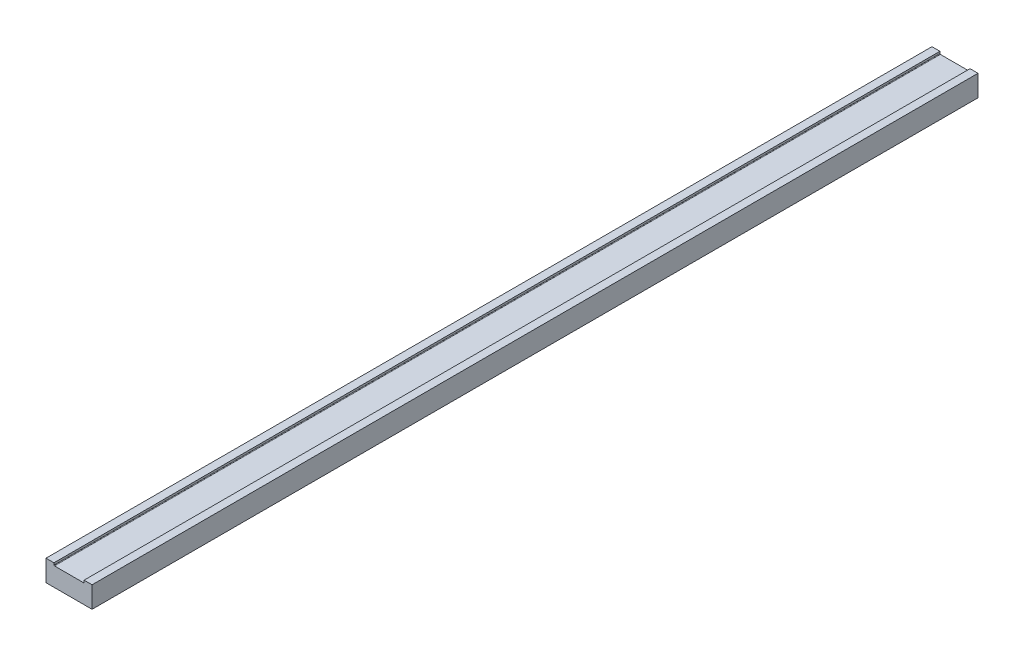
ISO-10303-21;
HEADER;
FILE_DESCRIPTION(('STEP AP214'),'2;1');
FILE_NAME('part.step','',(''),(''),'','','');
FILE_SCHEMA(('AUTOMOTIVE_DESIGN { 1 0 10303 214 1 1 1 1 }'));
ENDSEC;
DATA;
#1=APPLICATION_CONTEXT('core data for automotive mechanical design processes');
#2=APPLICATION_PROTOCOL_DEFINITION('international standard','automotive_design',2000,#1);
#3=PRODUCT_CONTEXT('',#1,'mechanical');
#4=PRODUCT('Part','Part','',(#3));
#5=PRODUCT_RELATED_PRODUCT_CATEGORY('part','',(#4));
#6=PRODUCT_DEFINITION_FORMATION('','',#4);
#7=PRODUCT_DEFINITION_CONTEXT('part definition',#1,'design');
#8=PRODUCT_DEFINITION('design','',#6,#7);
#9=PRODUCT_DEFINITION_SHAPE('','',#8);
#10=(LENGTH_UNIT() NAMED_UNIT(*) SI_UNIT(.MILLI.,.METRE.));
#11=(NAMED_UNIT(*) PLANE_ANGLE_UNIT() SI_UNIT($,.RADIAN.));
#12=(NAMED_UNIT(*) SI_UNIT($,.STERADIAN.) SOLID_ANGLE_UNIT());
#13=UNCERTAINTY_MEASURE_WITH_UNIT(LENGTH_MEASURE(1.E-05),#10,'distance_accuracy_value','');
#14=(GEOMETRIC_REPRESENTATION_CONTEXT(3) GLOBAL_UNCERTAINTY_ASSIGNED_CONTEXT((#13)) GLOBAL_UNIT_ASSIGNED_CONTEXT((#10,
#11,#12)) REPRESENTATION_CONTEXT('',''));
#15=CARTESIAN_POINT('',(0.,0.,0.));
#16=DIRECTION('',(0.,0.,1.));
#17=DIRECTION('',(1.,0.,0.));
#18=AXIS2_PLACEMENT_3D('',#15,#16,#17);
#19=CARTESIAN_POINT('',(-13.,12.,0.));
#20=DIRECTION('',(-1.,0.,0.));
#21=DIRECTION('',(0.,0.,1.));
#22=AXIS2_PLACEMENT_3D('',#19,#20,#21);
#23=PLANE('',#22);
#24=DIRECTION('',(0.,-1.,0.));
#25=VECTOR('',#24,1.);
#26=CARTESIAN_POINT('',(-13.,12.,500.));
#27=LINE('',#26,#25);
#28=CARTESIAN_POINT('',(-13.,12.,500.));
#29=VERTEX_POINT('',#28);
#30=CARTESIAN_POINT('',(-13.,0.,500.));
#31=VERTEX_POINT('',#30);
#32=EDGE_CURVE('E124',#29,#31,#27,.T.);
#33=ORIENTED_EDGE('',*,*,#32,.F.);
#34=DIRECTION('',(0.,0.,1.));
#35=VECTOR('',#34,1.);
#36=CARTESIAN_POINT('',(-13.,12.,0.));
#37=LINE('',#36,#35);
#38=CARTESIAN_POINT('',(-13.,12.,0.));
#39=VERTEX_POINT('',#38);
#40=EDGE_CURVE('E9',#39,#29,#37,.T.);
#41=ORIENTED_EDGE('',*,*,#40,.F.);
#42=DIRECTION('',(0.,-1.,0.));
#43=VECTOR('',#42,1.);
#44=CARTESIAN_POINT('',(-13.,12.,0.));
#45=LINE('',#44,#43);
#46=CARTESIAN_POINT('',(-13.,0.,0.));
#47=VERTEX_POINT('',#46);
#48=EDGE_CURVE('E146',#39,#47,#45,.T.);
#49=ORIENTED_EDGE('',*,*,#48,.T.);
#50=DIRECTION('',(0.,0.,1.));
#51=VECTOR('',#50,1.);
#52=CARTESIAN_POINT('',(-13.,0.,0.));
#53=LINE('',#52,#51);
#54=EDGE_CURVE('E17',#47,#31,#53,.T.);
#55=ORIENTED_EDGE('',*,*,#54,.T.);
#56=EDGE_LOOP('',(#33,#41,#49,#55));
#57=FACE_BOUND('',#56,.T.);
#58=ADVANCED_FACE('F14',(#57),#23,.T.);
#59=CARTESIAN_POINT('',(-13.,12.,0.));
#60=DIRECTION('',(0.,-1.,0.));
#61=DIRECTION('',(1.,0.,0.));
#62=AXIS2_PLACEMENT_3D('',#59,#60,#61);
#63=PLANE('',#62);
#64=DIRECTION('',(1.,0.,0.));
#65=VECTOR('',#64,1.);
#66=CARTESIAN_POINT('',(-13.,12.,500.));
#67=LINE('',#66,#65);
#68=CARTESIAN_POINT('',(-8.5,12.,500.));
#69=VERTEX_POINT('',#68);
#70=EDGE_CURVE('E65',#29,#69,#67,.T.);
#71=ORIENTED_EDGE('',*,*,#70,.T.);
#72=DIRECTION('',(0.,0.,1.));
#73=VECTOR('',#72,1.);
#74=CARTESIAN_POINT('',(-8.5,12.,0.));
#75=LINE('',#74,#73);
#76=CARTESIAN_POINT('',(-8.5,12.,0.));
#77=VERTEX_POINT('',#76);
#78=EDGE_CURVE('E23',#77,#69,#75,.T.);
#79=ORIENTED_EDGE('',*,*,#78,.F.);
#80=DIRECTION('',(1.,0.,0.));
#81=VECTOR('',#80,1.);
#82=CARTESIAN_POINT('',(-13.,12.,0.));
#83=LINE('',#82,#81);
#84=EDGE_CURVE('E102',#39,#77,#83,.T.);
#85=ORIENTED_EDGE('',*,*,#84,.F.);
#86=ORIENTED_EDGE('',*,*,#40,.T.);
#87=EDGE_LOOP('',(#71,#79,#85,#86));
#88=FACE_BOUND('',#87,.T.);
#89=ADVANCED_FACE('F207',(#88),#63,.F.);
#90=CARTESIAN_POINT('',(-8.5,12.,0.));
#91=DIRECTION('',(-1.,-1.57702134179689E-13,0.));
#92=DIRECTION('',(1.57702134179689E-13,-1.,0.));
#93=AXIS2_PLACEMENT_3D('',#90,#91,#92);
#94=PLANE('',#93);
#95=DIRECTION('',(1.57702134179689E-13,-1.,0.));
#96=VECTOR('',#95,1.);
#97=CARTESIAN_POINT('',(-8.5,12.,500.));
#98=LINE('',#97,#96);
#99=CARTESIAN_POINT('',(-8.5,10.8999999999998,500.));
#100=VERTEX_POINT('',#99);
#101=EDGE_CURVE('E109',#69,#100,#98,.T.);
#102=ORIENTED_EDGE('',*,*,#101,.T.);
#103=DIRECTION('',(0.,0.,1.));
#104=VECTOR('',#103,1.);
#105=CARTESIAN_POINT('',(-8.5,10.8999999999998,0.));
#106=LINE('',#105,#104);
#107=CARTESIAN_POINT('',(-8.5,10.8999999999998,0.));
#108=VERTEX_POINT('',#107);
#109=EDGE_CURVE('E106',#108,#100,#106,.T.);
#110=ORIENTED_EDGE('',*,*,#109,.F.);
#111=DIRECTION('',(1.57702134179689E-13,-1.,0.));
#112=VECTOR('',#111,1.);
#113=CARTESIAN_POINT('',(-8.5,12.,0.));
#114=LINE('',#113,#112);
#115=EDGE_CURVE('E95',#77,#108,#114,.T.);
#116=ORIENTED_EDGE('',*,*,#115,.F.);
#117=ORIENTED_EDGE('',*,*,#78,.T.);
#118=EDGE_LOOP('',(#102,#110,#116,#117));
#119=FACE_BOUND('',#118,.T.);
#120=ADVANCED_FACE('F107',(#119),#94,.F.);
#121=CARTESIAN_POINT('',(-8.2,10.8999999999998,0.));
#122=DIRECTION('',(0.,0.,1.));
#123=DIRECTION('',(1.,0.,0.));
#124=AXIS2_PLACEMENT_3D('',#121,#122,#123);
#125=CYLINDRICAL_SURFACE('',#124,0.299999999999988);
#126=CARTESIAN_POINT('',(-8.2,10.8999999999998,500.));
#127=DIRECTION('',(0.,0.,1.));
#128=DIRECTION('',(1.,0.,0.));
#129=AXIS2_PLACEMENT_3D('',#126,#127,#128);
#130=CIRCLE('',#129,0.299999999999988);
#131=CARTESIAN_POINT('',(-8.2,10.5999999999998,500.));
#132=VERTEX_POINT('',#131);
#133=EDGE_CURVE('E143',#100,#132,#130,.T.);
#134=ORIENTED_EDGE('',*,*,#133,.T.);
#135=DIRECTION('',(0.,0.,1.));
#136=VECTOR('',#135,1.);
#137=CARTESIAN_POINT('',(-8.2,10.5999999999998,0.));
#138=LINE('',#137,#136);
#139=CARTESIAN_POINT('',(-8.2,10.5999999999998,0.));
#140=VERTEX_POINT('',#139);
#141=EDGE_CURVE('E112',#140,#132,#138,.T.);
#142=ORIENTED_EDGE('',*,*,#141,.F.);
#143=CARTESIAN_POINT('',(-8.2,10.8999999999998,0.));
#144=DIRECTION('',(0.,0.,1.));
#145=DIRECTION('',(1.,0.,0.));
#146=AXIS2_PLACEMENT_3D('',#143,#144,#145);
#147=CIRCLE('',#146,0.299999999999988);
#148=EDGE_CURVE('E100',#108,#140,#147,.T.);
#149=ORIENTED_EDGE('',*,*,#148,.F.);
#150=ORIENTED_EDGE('',*,*,#109,.T.);
#151=EDGE_LOOP('',(#134,#142,#149,#150));
#152=FACE_BOUND('',#151,.T.);
#153=ADVANCED_FACE('F114',(#152),#125,.F.);
#154=CARTESIAN_POINT('',(-8.2,10.5999999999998,0.));
#155=DIRECTION('',(0.,-1.,0.));
#156=DIRECTION('',(1.,0.,0.));
#157=AXIS2_PLACEMENT_3D('',#154,#155,#156);
#158=PLANE('',#157);
#159=DIRECTION('',(1.,0.,0.));
#160=VECTOR('',#159,1.);
#161=CARTESIAN_POINT('',(-8.2,10.5999999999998,500.));
#162=LINE('',#161,#160);
#163=CARTESIAN_POINT('',(8.2,10.5999999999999,500.));
#164=VERTEX_POINT('',#163);
#165=EDGE_CURVE('E141',#132,#164,#162,.T.);
#166=ORIENTED_EDGE('',*,*,#165,.T.);
#167=DIRECTION('',(0.,0.,1.));
#168=VECTOR('',#167,1.);
#169=CARTESIAN_POINT('',(8.2,10.5999999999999,0.));
#170=LINE('',#169,#168);
#171=CARTESIAN_POINT('',(8.2,10.5999999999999,0.));
#172=VERTEX_POINT('',#171);
#173=EDGE_CURVE('E150',#172,#164,#170,.T.);
#174=ORIENTED_EDGE('',*,*,#173,.F.);
#175=DIRECTION('',(1.,0.,0.));
#176=VECTOR('',#175,1.);
#177=CARTESIAN_POINT('',(-8.2,10.5999999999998,0.));
#178=LINE('',#177,#176);
#179=EDGE_CURVE('E117',#140,#172,#178,.T.);
#180=ORIENTED_EDGE('',*,*,#179,.F.);
#181=ORIENTED_EDGE('',*,*,#141,.T.);
#182=EDGE_LOOP('',(#166,#174,#180,#181));
#183=FACE_BOUND('',#182,.T.);
#184=ADVANCED_FACE('F168',(#183),#158,.F.);
#185=CARTESIAN_POINT('',(8.2,10.8999999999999,0.));
#186=DIRECTION('',(0.,0.,1.));
#187=DIRECTION('',(1.,0.,0.));
#188=AXIS2_PLACEMENT_3D('',#185,#186,#187);
#189=CYLINDRICAL_SURFACE('',#188,0.300000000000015);
#190=CARTESIAN_POINT('',(8.2,10.8999999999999,500.));
#191=DIRECTION('',(0.,0.,1.));
#192=DIRECTION('',(1.,0.,0.));
#193=AXIS2_PLACEMENT_3D('',#190,#191,#192);
#194=CIRCLE('',#193,0.300000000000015);
#195=CARTESIAN_POINT('',(8.5,10.8999999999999,500.));
#196=VERTEX_POINT('',#195);
#197=EDGE_CURVE('E138',#164,#196,#194,.T.);
#198=ORIENTED_EDGE('',*,*,#197,.T.);
#199=DIRECTION('',(0.,0.,1.));
#200=VECTOR('',#199,1.);
#201=CARTESIAN_POINT('',(8.5,10.8999999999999,0.));
#202=LINE('',#201,#200);
#203=CARTESIAN_POINT('',(8.5,10.8999999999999,0.));
#204=VERTEX_POINT('',#203);
#205=EDGE_CURVE('E153',#204,#196,#202,.T.);
#206=ORIENTED_EDGE('',*,*,#205,.F.);
#207=CARTESIAN_POINT('',(8.2,10.8999999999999,0.));
#208=DIRECTION('',(0.,0.,1.));
#209=DIRECTION('',(1.,0.,0.));
#210=AXIS2_PLACEMENT_3D('',#207,#208,#209);
#211=CIRCLE('',#210,0.300000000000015);
#212=EDGE_CURVE('E119',#172,#204,#211,.T.);
#213=ORIENTED_EDGE('',*,*,#212,.F.);
#214=ORIENTED_EDGE('',*,*,#173,.T.);
#215=EDGE_LOOP('',(#198,#206,#213,#214));
#216=FACE_BOUND('',#215,.T.);
#217=ADVANCED_FACE('F176',(#216),#189,.F.);
#218=CARTESIAN_POINT('',(8.5,12.,0.));
#219=DIRECTION('',(-1.,0.,0.));
#220=DIRECTION('',(0.,0.,1.));
#221=AXIS2_PLACEMENT_3D('',#218,#219,#220);
#222=PLANE('',#221);
#223=DIRECTION('',(0.,-1.,0.));
#224=VECTOR('',#223,1.);
#225=CARTESIAN_POINT('',(8.5,12.,500.));
#226=LINE('',#225,#224);
#227=CARTESIAN_POINT('',(8.5,12.,500.));
#228=VERTEX_POINT('',#227);
#229=EDGE_CURVE('E135',#228,#196,#226,.T.);
#230=ORIENTED_EDGE('',*,*,#229,.F.);
#231=DIRECTION('',(0.,0.,1.));
#232=VECTOR('',#231,1.);
#233=CARTESIAN_POINT('',(8.5,12.,0.));
#234=LINE('',#233,#232);
#235=CARTESIAN_POINT('',(8.5,12.,0.));
#236=VERTEX_POINT('',#235);
#237=EDGE_CURVE('E155',#236,#228,#234,.T.);
#238=ORIENTED_EDGE('',*,*,#237,.F.);
#239=DIRECTION('',(0.,-1.,0.));
#240=VECTOR('',#239,1.);
#241=CARTESIAN_POINT('',(8.5,12.,0.));
#242=LINE('',#241,#240);
#243=EDGE_CURVE('E174',#236,#204,#242,.T.);
#244=ORIENTED_EDGE('',*,*,#243,.T.);
#245=ORIENTED_EDGE('',*,*,#205,.T.);
#246=EDGE_LOOP('',(#230,#238,#244,#245));
#247=FACE_BOUND('',#246,.T.);
#248=ADVANCED_FACE('F179',(#247),#222,.T.);
#249=CARTESIAN_POINT('',(8.5,12.,0.));
#250=DIRECTION('',(0.,-1.,0.));
#251=DIRECTION('',(0.,0.,-1.));
#252=AXIS2_PLACEMENT_3D('',#249,#250,#251);
#253=PLANE('',#252);
#254=DIRECTION('',(1.,0.,0.));
#255=VECTOR('',#254,1.);
#256=CARTESIAN_POINT('',(8.5,12.,500.));
#257=LINE('',#256,#255);
#258=CARTESIAN_POINT('',(13.,12.,500.));
#259=VERTEX_POINT('',#258);
#260=EDGE_CURVE('E133',#228,#259,#257,.T.);
#261=ORIENTED_EDGE('',*,*,#260,.T.);
#262=DIRECTION('',(0.,0.,1.));
#263=VECTOR('',#262,1.);
#264=CARTESIAN_POINT('',(13.,12.,0.));
#265=LINE('',#264,#263);
#266=CARTESIAN_POINT('',(13.,12.,0.));
#267=VERTEX_POINT('',#266);
#268=EDGE_CURVE('E157',#267,#259,#265,.T.);
#269=ORIENTED_EDGE('',*,*,#268,.F.);
#270=DIRECTION('',(1.,0.,0.));
#271=VECTOR('',#270,1.);
#272=CARTESIAN_POINT('',(8.5,12.,0.));
#273=LINE('',#272,#271);
#274=EDGE_CURVE('E181',#236,#267,#273,.T.);
#275=ORIENTED_EDGE('',*,*,#274,.F.);
#276=ORIENTED_EDGE('',*,*,#237,.T.);
#277=EDGE_LOOP('',(#261,#269,#275,#276));
#278=FACE_BOUND('',#277,.T.);
#279=ADVANCED_FACE('F195',(#278),#253,.F.);
#280=CARTESIAN_POINT('',(13.,12.,0.));
#281=DIRECTION('',(-1.,0.,0.));
#282=DIRECTION('',(0.,-1.,0.));
#283=AXIS2_PLACEMENT_3D('',#280,#281,#282);
#284=PLANE('',#283);
#285=DIRECTION('',(0.,-1.,0.));
#286=VECTOR('',#285,1.);
#287=CARTESIAN_POINT('',(13.,12.,500.));
#288=LINE('',#287,#286);
#289=CARTESIAN_POINT('',(13.,0.,500.));
#290=VERTEX_POINT('',#289);
#291=EDGE_CURVE('E130',#259,#290,#288,.T.);
#292=ORIENTED_EDGE('',*,*,#291,.T.);
#293=DIRECTION('',(0.,0.,1.));
#294=VECTOR('',#293,1.);
#295=CARTESIAN_POINT('',(13.,0.,0.));
#296=LINE('',#295,#294);
#297=CARTESIAN_POINT('',(13.,0.,0.));
#298=VERTEX_POINT('',#297);
#299=EDGE_CURVE('E159',#298,#290,#296,.T.);
#300=ORIENTED_EDGE('',*,*,#299,.F.);
#301=DIRECTION('',(0.,-1.,0.));
#302=VECTOR('',#301,1.);
#303=CARTESIAN_POINT('',(13.,12.,0.));
#304=LINE('',#303,#302);
#305=EDGE_CURVE('E183',#267,#298,#304,.T.);
#306=ORIENTED_EDGE('',*,*,#305,.F.);
#307=ORIENTED_EDGE('',*,*,#268,.T.);
#308=EDGE_LOOP('',(#292,#300,#306,#307));
#309=FACE_BOUND('',#308,.T.);
#310=ADVANCED_FACE('F192',(#309),#284,.F.);
#311=CARTESIAN_POINT('',(-13.,0.,0.));
#312=DIRECTION('',(0.,-1.,0.));
#313=DIRECTION('',(1.,0.,0.));
#314=AXIS2_PLACEMENT_3D('',#311,#312,#313);
#315=PLANE('',#314);
#316=DIRECTION('',(1.,0.,0.));
#317=VECTOR('',#316,1.);
#318=CARTESIAN_POINT('',(-13.,0.,500.));
#319=LINE('',#318,#317);
#320=EDGE_CURVE('E127',#31,#290,#319,.T.);
#321=ORIENTED_EDGE('',*,*,#320,.F.);
#322=ORIENTED_EDGE('',*,*,#54,.F.);
#323=DIRECTION('',(1.,0.,0.));
#324=VECTOR('',#323,1.);
#325=CARTESIAN_POINT('',(-13.,0.,0.));
#326=LINE('',#325,#324);
#327=EDGE_CURVE('E187',#47,#298,#326,.T.);
#328=ORIENTED_EDGE('',*,*,#327,.T.);
#329=ORIENTED_EDGE('',*,*,#299,.T.);
#330=EDGE_LOOP('',(#321,#322,#328,#329));
#331=FACE_BOUND('',#330,.T.);
#332=ADVANCED_FACE('F161',(#331),#315,.T.);
#333=CARTESIAN_POINT('',(8.2,10.8999999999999,0.));
#334=DIRECTION('',(0.,0.,1.));
#335=DIRECTION('',(1.,0.,0.));
#336=AXIS2_PLACEMENT_3D('',#333,#334,#335);
#337=PLANE('',#336);
#338=ORIENTED_EDGE('',*,*,#48,.F.);
#339=ORIENTED_EDGE('',*,*,#84,.T.);
#340=ORIENTED_EDGE('',*,*,#115,.T.);
#341=ORIENTED_EDGE('',*,*,#148,.T.);
#342=ORIENTED_EDGE('',*,*,#179,.T.);
#343=ORIENTED_EDGE('',*,*,#212,.T.);
#344=ORIENTED_EDGE('',*,*,#243,.F.);
#345=ORIENTED_EDGE('',*,*,#274,.T.);
#346=ORIENTED_EDGE('',*,*,#305,.T.);
#347=ORIENTED_EDGE('',*,*,#327,.F.);
#348=EDGE_LOOP('',(#338,#339,#340,#341,#342,#343,#344,#345,#346,#347));
#349=FACE_BOUND('',#348,.T.);
#350=ADVANCED_FACE('F98',(#349),#337,.F.);
#351=CARTESIAN_POINT('',(8.2,10.8999999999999,500.));
#352=DIRECTION('',(0.,0.,1.));
#353=DIRECTION('',(1.,0.,0.));
#354=AXIS2_PLACEMENT_3D('',#351,#352,#353);
#355=PLANE('',#354);
#356=ORIENTED_EDGE('',*,*,#32,.T.);
#357=ORIENTED_EDGE('',*,*,#320,.T.);
#358=ORIENTED_EDGE('',*,*,#291,.F.);
#359=ORIENTED_EDGE('',*,*,#260,.F.);
#360=ORIENTED_EDGE('',*,*,#229,.T.);
#361=ORIENTED_EDGE('',*,*,#197,.F.);
#362=ORIENTED_EDGE('',*,*,#165,.F.);
#363=ORIENTED_EDGE('',*,*,#133,.F.);
#364=ORIENTED_EDGE('',*,*,#101,.F.);
#365=ORIENTED_EDGE('',*,*,#70,.F.);
#366=EDGE_LOOP('',(#356,#357,#358,#359,#360,#361,#362,#363,#364,#365));
#367=FACE_BOUND('',#366,.T.);
#368=ADVANCED_FACE('F164',(#367),#355,.T.);
#369=CLOSED_SHELL('',(#58,#89,#120,#153,#184,#217,#248,#279,#310,#332,#350,#368));
#370=MANIFOLD_SOLID_BREP('B1',#369);
#371=ADVANCED_BREP_SHAPE_REPRESENTATION('',(#18,#370),#14);
#372=SHAPE_DEFINITION_REPRESENTATION(#9,#371);
ENDSEC;
END-ISO-10303-21;
